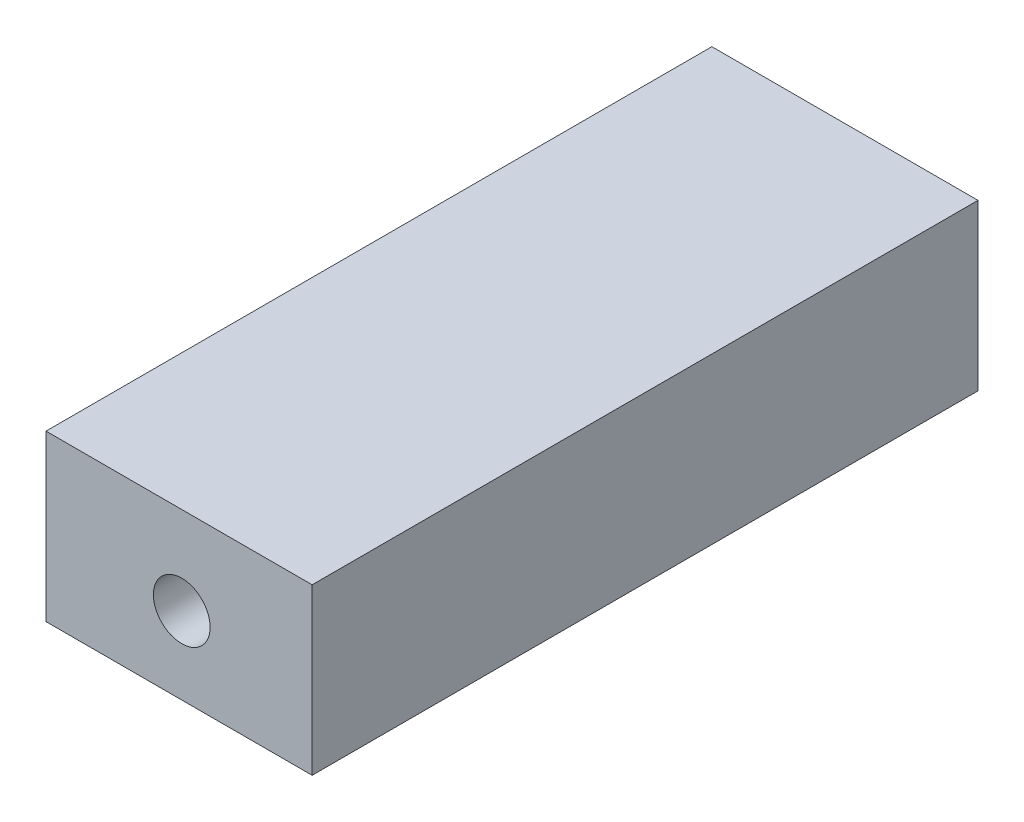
from build123d import *

# Parameters (mm, degrees)
SKETCH1_W                  = 12.690547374
SKETCH1_H                  = 7.868139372
EXTRUDE1_DEPTH             = 31.75
TAP_DRILL_FOR_6_TAP1_D     = 2.7051
TAP_DRILL_FOR_6_TAP1_DEPTH = 10.16
TAP_DRILL_FOR_6_TAP1_TIP   = 0.81269403


with BuildPart() as part:
    # Sketch1 → Extrude1 (new body)
    with BuildSketch(Plane.XY):
        with Locations((6.345273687, 3.934069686)):
            Rectangle(SKETCH1_W, SKETCH1_H)
    extrude(amount=EXTRUDE1_DEPTH)

    # Tap Drill for _6 Tap1
    with Locations(Plane(origin=(6.473060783, 3.679823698, 31.75), x_dir=(1, 0, 0), z_dir=(0, 0, 1))):
        with Locations((0, 0)):
            Hole(TAP_DRILL_FOR_6_TAP1_D / 2, depth=TAP_DRILL_FOR_6_TAP1_DEPTH)
            with Locations((0, 0, -(TAP_DRILL_FOR_6_TAP1_DEPTH + TAP_DRILL_FOR_6_TAP1_TIP / 2))):  # 118° drill point
                Cone(0, TAP_DRILL_FOR_6_TAP1_D / 2, TAP_DRILL_FOR_6_TAP1_TIP, mode=Mode.SUBTRACT)


solid = part.part
